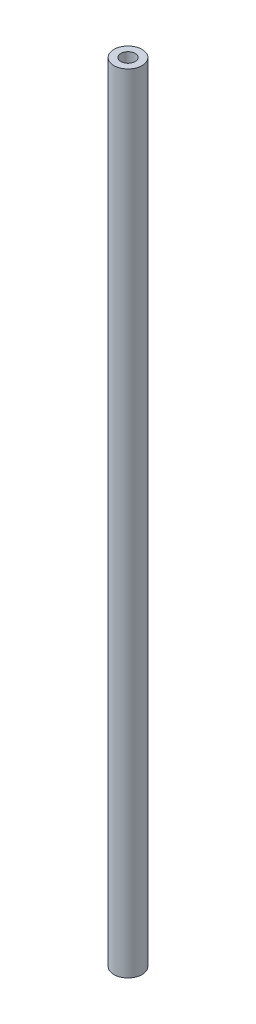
ISO-10303-21;
HEADER;
FILE_DESCRIPTION(('STEP AP214'),'2;1');
FILE_NAME('part.step','',(''),(''),'','','');
FILE_SCHEMA(('AUTOMOTIVE_DESIGN { 1 0 10303 214 1 1 1 1 }'));
ENDSEC;
DATA;
#1=APPLICATION_CONTEXT('core data for automotive mechanical design processes');
#2=APPLICATION_PROTOCOL_DEFINITION('international standard','automotive_design',2000,#1);
#3=PRODUCT_CONTEXT('',#1,'mechanical');
#4=PRODUCT('Part','Part','',(#3));
#5=PRODUCT_RELATED_PRODUCT_CATEGORY('part','',(#4));
#6=PRODUCT_DEFINITION_FORMATION('','',#4);
#7=PRODUCT_DEFINITION_CONTEXT('part definition',#1,'design');
#8=PRODUCT_DEFINITION('design','',#6,#7);
#9=PRODUCT_DEFINITION_SHAPE('','',#8);
#10=(LENGTH_UNIT() NAMED_UNIT(*) SI_UNIT(.MILLI.,.METRE.));
#11=(NAMED_UNIT(*) PLANE_ANGLE_UNIT() SI_UNIT($,.RADIAN.));
#12=(NAMED_UNIT(*) SI_UNIT($,.STERADIAN.) SOLID_ANGLE_UNIT());
#13=UNCERTAINTY_MEASURE_WITH_UNIT(LENGTH_MEASURE(1.E-05),#10,'distance_accuracy_value','');
#14=(GEOMETRIC_REPRESENTATION_CONTEXT(3) GLOBAL_UNCERTAINTY_ASSIGNED_CONTEXT((#13)) GLOBAL_UNIT_ASSIGNED_CONTEXT((#10,
#11,#12)) REPRESENTATION_CONTEXT('',''));
#15=CARTESIAN_POINT('',(0.,0.,0.));
#16=DIRECTION('',(0.,0.,1.));
#17=DIRECTION('',(1.,0.,0.));
#18=AXIS2_PLACEMENT_3D('',#15,#16,#17);
#19=CARTESIAN_POINT('',(0.,266.7,0.));
#20=DIRECTION('',(0.,1.,0.));
#21=DIRECTION('',(0.,0.,1.));
#22=AXIS2_PLACEMENT_3D('',#19,#20,#21);
#23=PLANE('',#22);
#24=CARTESIAN_POINT('',(0.,266.7,0.));
#25=DIRECTION('',(0.,1.,0.));
#26=DIRECTION('',(0.,0.,1.));
#27=AXIS2_PLACEMENT_3D('',#24,#25,#26);
#28=CIRCLE('',#27,2.41299999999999);
#29=CARTESIAN_POINT('',(0.,266.7,2.41299999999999));
#30=VERTEX_POINT('',#29);
#31=EDGE_CURVE('E77',#30,#30,#28,.T.);
#32=ORIENTED_EDGE('',*,*,#31,.F.);
#33=EDGE_LOOP('',(#32));
#34=FACE_BOUND('',#33,.T.);
#35=CARTESIAN_POINT('',(0.,266.7,0.));
#36=DIRECTION('',(0.,1.,0.));
#37=DIRECTION('',(0.,0.,1.));
#38=AXIS2_PLACEMENT_3D('',#35,#36,#37);
#39=CIRCLE('',#38,4.7625);
#40=CARTESIAN_POINT('',(0.,266.7,4.7625));
#41=VERTEX_POINT('',#40);
#42=EDGE_CURVE('E10',#41,#41,#39,.T.);
#43=ORIENTED_EDGE('',*,*,#42,.T.);
#44=EDGE_LOOP('',(#43));
#45=FACE_BOUND('',#44,.T.);
#46=ADVANCED_FACE('F33',(#34,#45),#23,.T.);
#47=CARTESIAN_POINT('',(0.,0.,0.));
#48=DIRECTION('',(0.,1.,0.));
#49=DIRECTION('',(0.,0.,1.));
#50=AXIS2_PLACEMENT_3D('',#47,#48,#49);
#51=PLANE('',#50);
#52=CARTESIAN_POINT('',(0.,-1.2490009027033E-13,0.));
#53=DIRECTION('',(0.,-1.,0.));
#54=DIRECTION('',(0.,0.,-1.));
#55=AXIS2_PLACEMENT_3D('',#52,#53,#54);
#56=CIRCLE('',#55,2.413);
#57=CARTESIAN_POINT('',(0.,-1.2490009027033E-13,-2.413));
#58=VERTEX_POINT('',#57);
#59=EDGE_CURVE('E63',#58,#58,#56,.T.);
#60=ORIENTED_EDGE('',*,*,#59,.F.);
#61=EDGE_LOOP('',(#60));
#62=FACE_BOUND('',#61,.T.);
#63=CARTESIAN_POINT('',(0.,0.,0.));
#64=DIRECTION('',(0.,1.,0.));
#65=DIRECTION('',(0.,0.,1.));
#66=AXIS2_PLACEMENT_3D('',#63,#64,#65);
#67=CIRCLE('',#66,4.7625);
#68=CARTESIAN_POINT('',(0.,0.,4.7625));
#69=VERTEX_POINT('',#68);
#70=EDGE_CURVE('E41',#69,#69,#67,.T.);
#71=ORIENTED_EDGE('',*,*,#70,.F.);
#72=EDGE_LOOP('',(#71));
#73=FACE_BOUND('',#72,.T.);
#74=ADVANCED_FACE('F84',(#62,#73),#51,.F.);
#75=CARTESIAN_POINT('',(0.,266.7,0.));
#76=DIRECTION('',(0.,-1.,0.));
#77=DIRECTION('',(0.,0.,-1.));
#78=AXIS2_PLACEMENT_3D('',#75,#76,#77);
#79=CYLINDRICAL_SURFACE('',#78,4.7625);
#80=ORIENTED_EDGE('',*,*,#42,.F.);
#81=EDGE_LOOP('',(#80));
#82=FACE_BOUND('',#81,.T.);
#83=ORIENTED_EDGE('',*,*,#70,.T.);
#84=EDGE_LOOP('',(#83));
#85=FACE_BOUND('',#84,.T.);
#86=ADVANCED_FACE('F35',(#82,#85),#79,.T.);
#87=CARTESIAN_POINT('',(0.,266.7,0.));
#88=DIRECTION('',(0.,-1.,0.));
#89=DIRECTION('',(0.,0.,-1.));
#90=AXIS2_PLACEMENT_3D('',#87,#88,#89);
#91=CYLINDRICAL_SURFACE('',#90,1.8415);
#92=CARTESIAN_POINT('',(0.,234.843166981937,0.));
#93=DIRECTION('',(0.,1.,0.));
#94=DIRECTION('',(0.,0.,1.));
#95=AXIS2_PLACEMENT_3D('',#92,#93,#94);
#96=CIRCLE('',#95,1.8415);
#97=CARTESIAN_POINT('',(0.,234.843166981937,1.8415));
#98=VERTEX_POINT('',#97);
#99=EDGE_CURVE('E37',#98,#98,#96,.F.);
#100=ORIENTED_EDGE('',*,*,#99,.F.);
#101=EDGE_LOOP('',(#100));
#102=FACE_BOUND('',#101,.T.);
#103=CARTESIAN_POINT('',(0.,31.8568330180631,0.));
#104=DIRECTION('',(0.,-1.,0.));
#105=DIRECTION('',(0.,0.,-1.));
#106=AXIS2_PLACEMENT_3D('',#103,#104,#105);
#107=CIRCLE('',#106,1.8415);
#108=CARTESIAN_POINT('',(0.,31.8568330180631,-1.8415));
#109=VERTEX_POINT('',#108);
#110=EDGE_CURVE('E46',#109,#109,#107,.F.);
#111=ORIENTED_EDGE('',*,*,#110,.F.);
#112=EDGE_LOOP('',(#111));
#113=FACE_BOUND('',#112,.T.);
#114=ADVANCED_FACE('F91',(#102,#113),#91,.F.);
#115=CARTESIAN_POINT('',(0.,31.75,0.));
#116=DIRECTION('',(0.,-1.,0.));
#117=DIRECTION('',(0.,0.,-1.));
#118=AXIS2_PLACEMENT_3D('',#115,#116,#117);
#119=CONICAL_SURFACE('',#118,2.01929999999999,1.02974425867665);
#120=ORIENTED_EDGE('',*,*,#110,.T.);
#121=EDGE_LOOP('',(#120));
#122=FACE_BOUND('',#121,.T.);
#123=CARTESIAN_POINT('',(0.,31.75,0.));
#124=DIRECTION('',(0.,-1.,0.));
#125=DIRECTION('',(0.,0.,-1.));
#126=AXIS2_PLACEMENT_3D('',#123,#124,#125);
#127=CIRCLE('',#126,2.01929999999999);
#128=CARTESIAN_POINT('',(0.,31.75,-2.01929999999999));
#129=VERTEX_POINT('',#128);
#130=EDGE_CURVE('E49',#129,#129,#127,.T.);
#131=ORIENTED_EDGE('',*,*,#130,.T.);
#132=EDGE_LOOP('',(#131));
#133=FACE_BOUND('',#132,.T.);
#134=ADVANCED_FACE('F94',(#122,#133),#119,.F.);
#135=CARTESIAN_POINT('',(0.,0.,0.));
#136=DIRECTION('',(0.,-1.,0.));
#137=DIRECTION('',(0.,0.,-1.));
#138=AXIS2_PLACEMENT_3D('',#135,#136,#137);
#139=CYLINDRICAL_SURFACE('',#138,2.01929999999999);
#140=ORIENTED_EDGE('',*,*,#130,.F.);
#141=EDGE_LOOP('',(#140));
#142=FACE_BOUND('',#141,.T.);
#143=CARTESIAN_POINT('',(0.,25.4,0.));
#144=DIRECTION('',(0.,-1.,0.));
#145=DIRECTION('',(0.,0.,-1.));
#146=AXIS2_PLACEMENT_3D('',#143,#144,#145);
#147=CIRCLE('',#146,2.0193);
#148=CARTESIAN_POINT('',(0.,25.4,-2.0193));
#149=VERTEX_POINT('',#148);
#150=EDGE_CURVE('E55',#149,#149,#147,.T.);
#151=ORIENTED_EDGE('',*,*,#150,.T.);
#152=EDGE_LOOP('',(#151));
#153=FACE_BOUND('',#152,.T.);
#154=ADVANCED_FACE('F98',(#142,#153),#139,.F.);
#155=CARTESIAN_POINT('',(2.0193,25.4,0.));
#156=DIRECTION('',(0.,1.,0.));
#157=DIRECTION('',(0.,0.,1.));
#158=AXIS2_PLACEMENT_3D('',#155,#156,#157);
#159=PLANE('',#158);
#160=ORIENTED_EDGE('',*,*,#150,.F.);
#161=EDGE_LOOP('',(#160));
#162=FACE_BOUND('',#161,.T.);
#163=CARTESIAN_POINT('',(0.,25.4,0.));
#164=DIRECTION('',(0.,-1.,0.));
#165=DIRECTION('',(0.,0.,-1.));
#166=AXIS2_PLACEMENT_3D('',#163,#164,#165);
#167=CIRCLE('',#166,2.413);
#168=CARTESIAN_POINT('',(0.,25.4,-2.413));
#169=VERTEX_POINT('',#168);
#170=EDGE_CURVE('E59',#169,#169,#167,.T.);
#171=ORIENTED_EDGE('',*,*,#170,.T.);
#172=EDGE_LOOP('',(#171));
#173=FACE_BOUND('',#172,.T.);
#174=ADVANCED_FACE('F101',(#162,#173),#159,.F.);
#175=CARTESIAN_POINT('',(0.,0.,0.));
#176=DIRECTION('',(0.,-1.,0.));
#177=DIRECTION('',(0.,0.,-1.));
#178=AXIS2_PLACEMENT_3D('',#175,#176,#177);
#179=CYLINDRICAL_SURFACE('',#178,2.413);
#180=ORIENTED_EDGE('',*,*,#170,.F.);
#181=EDGE_LOOP('',(#180));
#182=FACE_BOUND('',#181,.T.);
#183=ORIENTED_EDGE('',*,*,#59,.T.);
#184=EDGE_LOOP('',(#183));
#185=FACE_BOUND('',#184,.T.);
#186=ADVANCED_FACE('F105',(#182,#185),#179,.F.);
#187=CARTESIAN_POINT('',(0.,234.95,0.));
#188=DIRECTION('',(0.,1.,0.));
#189=DIRECTION('',(0.,0.,1.));
#190=AXIS2_PLACEMENT_3D('',#187,#188,#189);
#191=CONICAL_SURFACE('',#190,2.01929999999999,1.02974425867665);
#192=ORIENTED_EDGE('',*,*,#99,.T.);
#193=EDGE_LOOP('',(#192));
#194=FACE_BOUND('',#193,.T.);
#195=CARTESIAN_POINT('',(0.,234.95,0.));
#196=DIRECTION('',(0.,1.,0.));
#197=DIRECTION('',(0.,0.,1.));
#198=AXIS2_PLACEMENT_3D('',#195,#196,#197);
#199=CIRCLE('',#198,2.01929999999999);
#200=CARTESIAN_POINT('',(0.,234.95,2.01929999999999));
#201=VERTEX_POINT('',#200);
#202=EDGE_CURVE('E68',#201,#201,#199,.T.);
#203=ORIENTED_EDGE('',*,*,#202,.T.);
#204=EDGE_LOOP('',(#203));
#205=FACE_BOUND('',#204,.T.);
#206=ADVANCED_FACE('F109',(#194,#205),#191,.F.);
#207=CARTESIAN_POINT('',(0.,266.7,0.));
#208=DIRECTION('',(0.,1.,0.));
#209=DIRECTION('',(0.,0.,1.));
#210=AXIS2_PLACEMENT_3D('',#207,#208,#209);
#211=CYLINDRICAL_SURFACE('',#210,2.01929999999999);
#212=ORIENTED_EDGE('',*,*,#202,.F.);
#213=EDGE_LOOP('',(#212));
#214=FACE_BOUND('',#213,.T.);
#215=CARTESIAN_POINT('',(0.,241.3,0.));
#216=DIRECTION('',(0.,1.,0.));
#217=DIRECTION('',(0.,0.,1.));
#218=AXIS2_PLACEMENT_3D('',#215,#216,#217);
#219=CIRCLE('',#218,2.01929999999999);
#220=CARTESIAN_POINT('',(0.,241.3,2.01929999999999));
#221=VERTEX_POINT('',#220);
#222=EDGE_CURVE('E71',#221,#221,#219,.T.);
#223=ORIENTED_EDGE('',*,*,#222,.T.);
#224=EDGE_LOOP('',(#223));
#225=FACE_BOUND('',#224,.T.);
#226=ADVANCED_FACE('F113',(#214,#225),#211,.F.);
#227=CARTESIAN_POINT('',(2.01929999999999,241.3,0.));
#228=DIRECTION('',(0.,-1.,0.));
#229=DIRECTION('',(0.,0.,-1.));
#230=AXIS2_PLACEMENT_3D('',#227,#228,#229);
#231=PLANE('',#230);
#232=ORIENTED_EDGE('',*,*,#222,.F.);
#233=EDGE_LOOP('',(#232));
#234=FACE_BOUND('',#233,.T.);
#235=CARTESIAN_POINT('',(0.,241.3,0.));
#236=DIRECTION('',(0.,1.,0.));
#237=DIRECTION('',(0.,0.,1.));
#238=AXIS2_PLACEMENT_3D('',#235,#236,#237);
#239=CIRCLE('',#238,2.41299999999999);
#240=CARTESIAN_POINT('',(0.,241.3,2.41299999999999));
#241=VERTEX_POINT('',#240);
#242=EDGE_CURVE('E74',#241,#241,#239,.T.);
#243=ORIENTED_EDGE('',*,*,#242,.T.);
#244=EDGE_LOOP('',(#243));
#245=FACE_BOUND('',#244,.T.);
#246=ADVANCED_FACE('F117',(#234,#245),#231,.F.);
#247=CARTESIAN_POINT('',(0.,266.7,0.));
#248=DIRECTION('',(0.,1.,0.));
#249=DIRECTION('',(0.,0.,1.));
#250=AXIS2_PLACEMENT_3D('',#247,#248,#249);
#251=CYLINDRICAL_SURFACE('',#250,2.41299999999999);
#252=ORIENTED_EDGE('',*,*,#242,.F.);
#253=EDGE_LOOP('',(#252));
#254=FACE_BOUND('',#253,.T.);
#255=ORIENTED_EDGE('',*,*,#31,.T.);
#256=EDGE_LOOP('',(#255));
#257=FACE_BOUND('',#256,.T.);
#258=ADVANCED_FACE('F81',(#254,#257),#251,.F.);
#259=CLOSED_SHELL('',(#46,#74,#86,#114,#134,#154,#174,#186,#206,#226,#246,#258));
#260=MANIFOLD_SOLID_BREP('B2',#259);
#261=ADVANCED_BREP_SHAPE_REPRESENTATION('',(#18,#260),#14);
#262=SHAPE_DEFINITION_REPRESENTATION(#9,#261);
ENDSEC;
END-ISO-10303-21;
